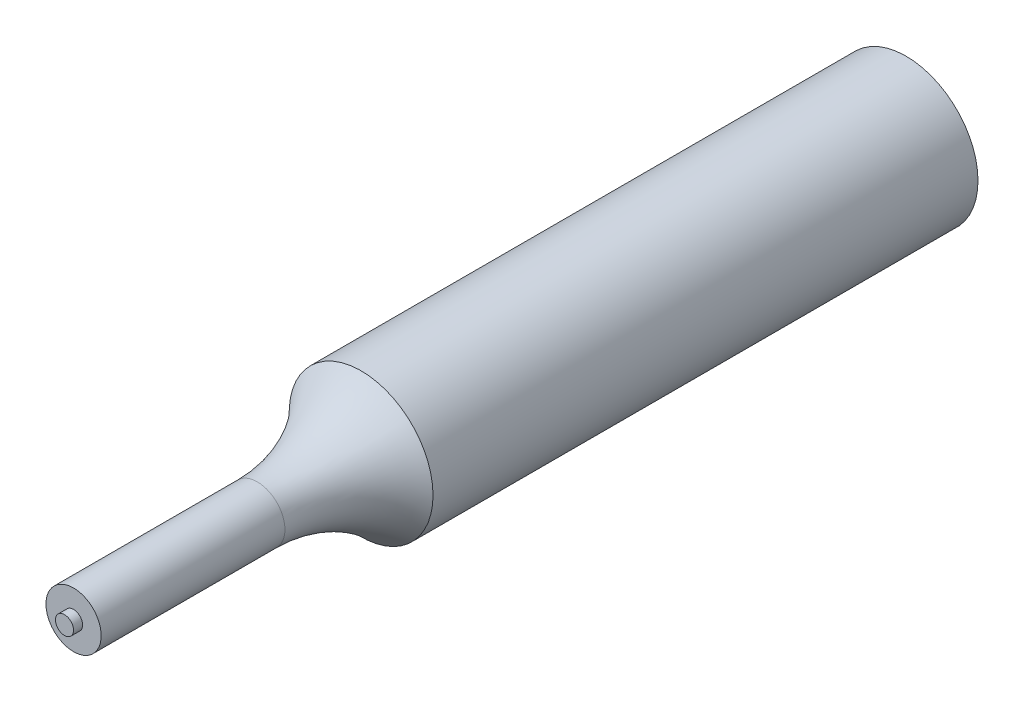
from build123d import *

# Parameters (mm, degrees)
LOGO3_BIB4_W = 0.8001
LOGO3_BIB4_H = 1.6002


with BuildPart() as part:
    # logo3_bib2 → Revolve2_Shoulder (revolve)
    with BuildSketch(Plane(origin=(0, 0, 0), x_dir=(1, 0, 0), z_dir=(0, 1, 0)), mode=Mode.PRIVATE) as revolve2_shoulder_sk:
        with BuildLine():
            Line((-6.35, -6.35), (0, -6.35))
            Line((0, -6.35), (0, -79.883))
            Line((0, -79.883), (-2.4384, -79.883))
            Line((-2.4384, -79.883), (-2.4384, -63.651098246))
            ThreePointArc((-2.4384, -63.651098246), (-3.457161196, -58.66725836), (-6.35, -54.483))
            Line((-6.35, -54.483), (-6.35, -6.35))
        make_face()
    revolve(revolve2_shoulder_sk.sketch.rotate(Axis((0, 0, 43.517168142), (0, 0, -1)), 180), axis=Axis((0, 0, 43.517168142), (0, 0, -1)))

    # logo3_bib4 → Revolve2_Shoulder_JT (revolve)
    with BuildSketch(Plane(origin=(0, 0, 0), x_dir=(1, 0, 0), z_dir=(0, 1, 0))):
        with Locations((-0.40005, -79.883)):
            Rectangle(LOGO3_BIB4_W, LOGO3_BIB4_H)
    revolve(axis=Axis((0, 0, 0), (0, 0, 1)))

    # Sketch1_2 → Cut-Revolve_Ball_Shoulder (revolve, cut)
    with BuildSketch(Plane(origin=(0, 0, 0), x_dir=(1, 0, 0), z_dir=(0, 1, 0))):
        with BuildLine():
            Line((-15.531628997, -25.178899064), (-9.398, -2.287884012))
            Line((-9.398, -2.287884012), (-9.398, -33.1724))
            ThreePointArc((-9.398, -33.1724), (-14.435793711, -30.688035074), (-15.531628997, -25.178899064))
        make_face()
    revolve(axis=Axis((-9.398, 0, 12.118432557), (0, 0, 1)), mode=Mode.SUBTRACT)


solid = part.part
